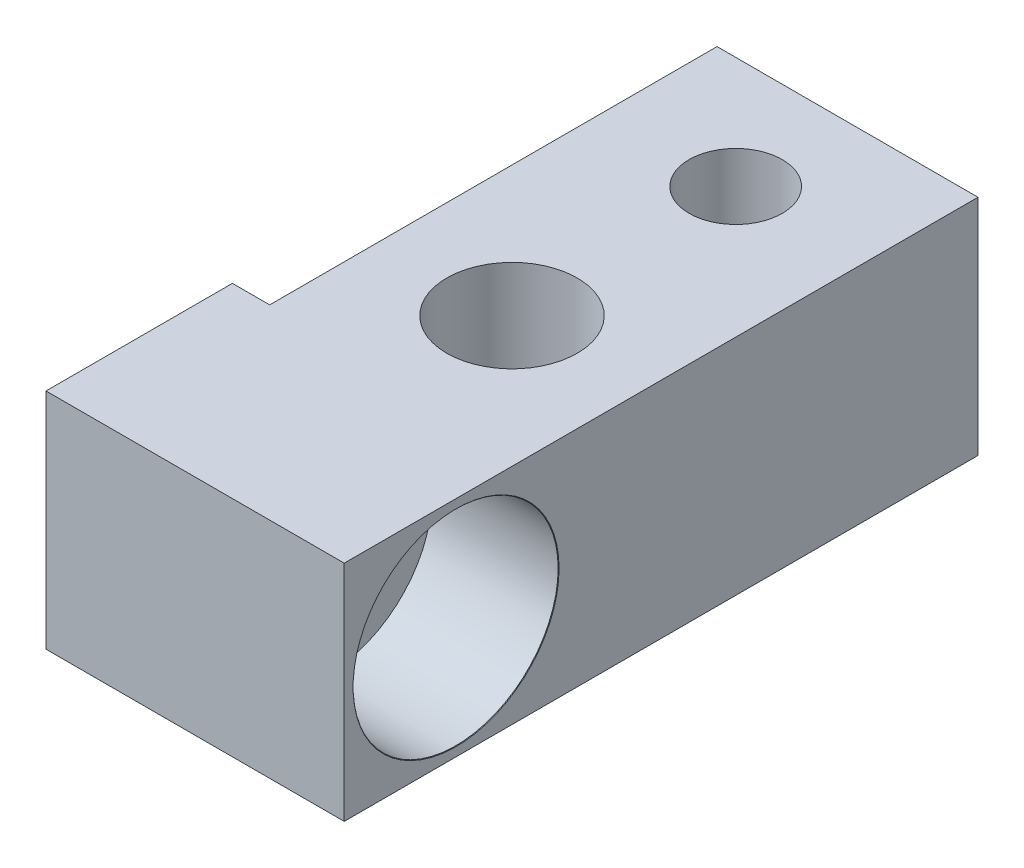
ISO-10303-21;
HEADER;
FILE_DESCRIPTION(('STEP AP214'),'2;1');
FILE_NAME('part.step','',(''),(''),'','','');
FILE_SCHEMA(('AUTOMOTIVE_DESIGN { 1 0 10303 214 1 1 1 1 }'));
ENDSEC;
DATA;
#1=APPLICATION_CONTEXT('core data for automotive mechanical design processes');
#2=APPLICATION_PROTOCOL_DEFINITION('international standard','automotive_design',2000,#1);
#3=PRODUCT_CONTEXT('',#1,'mechanical');
#4=PRODUCT('Part','Part','',(#3));
#5=PRODUCT_RELATED_PRODUCT_CATEGORY('part','',(#4));
#6=PRODUCT_DEFINITION_FORMATION('','',#4);
#7=PRODUCT_DEFINITION_CONTEXT('part definition',#1,'design');
#8=PRODUCT_DEFINITION('design','',#6,#7);
#9=PRODUCT_DEFINITION_SHAPE('','',#8);
#10=(LENGTH_UNIT() NAMED_UNIT(*) SI_UNIT(.MILLI.,.METRE.));
#11=(NAMED_UNIT(*) PLANE_ANGLE_UNIT() SI_UNIT($,.RADIAN.));
#12=(NAMED_UNIT(*) SI_UNIT($,.STERADIAN.) SOLID_ANGLE_UNIT());
#13=UNCERTAINTY_MEASURE_WITH_UNIT(LENGTH_MEASURE(1.E-05),#10,'distance_accuracy_value','');
#14=(GEOMETRIC_REPRESENTATION_CONTEXT(3) GLOBAL_UNCERTAINTY_ASSIGNED_CONTEXT((#13)) GLOBAL_UNIT_ASSIGNED_CONTEXT((#10,
#11,#12)) REPRESENTATION_CONTEXT('',''));
#15=CARTESIAN_POINT('',(0.,0.,0.));
#16=DIRECTION('',(0.,0.,1.));
#17=DIRECTION('',(1.,0.,0.));
#18=AXIS2_PLACEMENT_3D('',#15,#16,#17);
#19=CARTESIAN_POINT('',(87.5,11.1125258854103,-34.));
#20=DIRECTION('',(-1.,0.,0.));
#21=DIRECTION('',(0.,0.,1.));
#22=AXIS2_PLACEMENT_3D('',#19,#20,#21);
#23=PLANE('',#22);
#24=CARTESIAN_POINT('',(87.5,17.1125258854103,-6.));
#25=DIRECTION('',(1.,0.,0.));
#26=DIRECTION('',(0.,0.,-1.));
#27=AXIS2_PLACEMENT_3D('',#24,#25,#26);
#28=CIRCLE('',#27,3.325);
#29=CARTESIAN_POINT('',(87.5,17.1125258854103,-9.325));
#30=VERTEX_POINT('',#29);
#31=EDGE_CURVE('E150',#30,#30,#28,.T.);
#32=ORIENTED_EDGE('',*,*,#31,.T.);
#33=EDGE_LOOP('',(#32));
#34=FACE_BOUND('',#33,.T.);
#35=DIRECTION('',(0.,1.,0.));
#36=VECTOR('',#35,1.);
#37=CARTESIAN_POINT('',(87.5,11.1125258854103,-10.));
#38=LINE('',#37,#36);
#39=CARTESIAN_POINT('',(87.5,11.1125258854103,-10.));
#40=VERTEX_POINT('',#39);
#41=CARTESIAN_POINT('',(87.5,23.1125258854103,-10.));
#42=VERTEX_POINT('',#41);
#43=EDGE_CURVE('E108',#40,#42,#38,.T.);
#44=ORIENTED_EDGE('',*,*,#43,.F.);
#45=DIRECTION('',(0.,0.,1.));
#46=VECTOR('',#45,1.);
#47=CARTESIAN_POINT('',(87.5,11.1125258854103,-34.));
#48=LINE('',#47,#46);
#49=CARTESIAN_POINT('',(87.5,11.1125258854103,0.));
#50=VERTEX_POINT('',#49);
#51=EDGE_CURVE('E19',#40,#50,#48,.T.);
#52=ORIENTED_EDGE('',*,*,#51,.T.);
#53=DIRECTION('',(0.,-1.,0.));
#54=VECTOR('',#53,1.);
#55=CARTESIAN_POINT('',(87.5,11.1125258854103,0.));
#56=LINE('',#55,#54);
#57=CARTESIAN_POINT('',(87.5,23.1125258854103,0.));
#58=VERTEX_POINT('',#57);
#59=EDGE_CURVE('E67',#58,#50,#56,.T.);
#60=ORIENTED_EDGE('',*,*,#59,.F.);
#61=DIRECTION('',(0.,0.,1.));
#62=VECTOR('',#61,1.);
#63=CARTESIAN_POINT('',(87.5,23.1125258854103,-34.));
#64=LINE('',#63,#62);
#65=EDGE_CURVE('E11',#42,#58,#64,.T.);
#66=ORIENTED_EDGE('',*,*,#65,.F.);
#67=EDGE_LOOP('',(#44,#52,#60,#66));
#68=FACE_BOUND('',#67,.T.);
#69=ADVANCED_FACE('F16',(#34,#68),#23,.T.);
#70=CARTESIAN_POINT('',(87.5,23.1125258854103,-34.));
#71=DIRECTION('',(0.,1.,0.));
#72=DIRECTION('',(0.,0.,1.));
#73=AXIS2_PLACEMENT_3D('',#70,#71,#72);
#74=PLANE('',#73);
#75=CARTESIAN_POINT('',(96.5,23.1125258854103,-16.));
#76=DIRECTION('',(0.,1.,0.));
#77=DIRECTION('',(0.,0.,1.));
#78=AXIS2_PLACEMENT_3D('',#75,#76,#77);
#79=CIRCLE('',#78,3.5);
#80=CARTESIAN_POINT('',(96.5,23.1125258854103,-12.5));
#81=VERTEX_POINT('',#80);
#82=EDGE_CURVE('E129',#81,#81,#79,.T.);
#83=ORIENTED_EDGE('',*,*,#82,.F.);
#84=EDGE_LOOP('',(#83));
#85=FACE_BOUND('',#84,.T.);
#86=CARTESIAN_POINT('',(96.5,23.1125258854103,-28.));
#87=DIRECTION('',(0.,1.,0.));
#88=DIRECTION('',(0.,0.,1.));
#89=AXIS2_PLACEMENT_3D('',#86,#87,#88);
#90=CIRCLE('',#89,2.5);
#91=CARTESIAN_POINT('',(96.5,23.1125258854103,-25.5));
#92=VERTEX_POINT('',#91);
#93=EDGE_CURVE('E123',#92,#92,#90,.T.);
#94=ORIENTED_EDGE('',*,*,#93,.F.);
#95=EDGE_LOOP('',(#94));
#96=FACE_BOUND('',#95,.T.);
#97=DIRECTION('',(0.,0.,-1.));
#98=VECTOR('',#97,1.);
#99=CARTESIAN_POINT('',(89.5,23.1125258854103,-34.));
#100=LINE('',#99,#98);
#101=CARTESIAN_POINT('',(89.5,23.1125258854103,-10.));
#102=VERTEX_POINT('',#101);
#103=CARTESIAN_POINT('',(89.5,23.1125258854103,-34.));
#104=VERTEX_POINT('',#103);
#105=EDGE_CURVE('E32',#102,#104,#100,.T.);
#106=ORIENTED_EDGE('',*,*,#105,.F.);
#107=DIRECTION('',(1.,0.,0.));
#108=VECTOR('',#107,1.);
#109=CARTESIAN_POINT('',(87.5,23.1125258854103,-10.));
#110=LINE('',#109,#108);
#111=EDGE_CURVE('E63',#42,#102,#110,.T.);
#112=ORIENTED_EDGE('',*,*,#111,.F.);
#113=ORIENTED_EDGE('',*,*,#65,.T.);
#114=DIRECTION('',(-1.,0.,0.));
#115=VECTOR('',#114,1.);
#116=CARTESIAN_POINT('',(87.5,23.1125258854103,0.));
#117=LINE('',#116,#115);
#118=CARTESIAN_POINT('',(103.5,23.1125258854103,0.));
#119=VERTEX_POINT('',#118);
#120=EDGE_CURVE('E60',#119,#58,#117,.T.);
#121=ORIENTED_EDGE('',*,*,#120,.F.);
#122=DIRECTION('',(0.,0.,1.));
#123=VECTOR('',#122,1.);
#124=CARTESIAN_POINT('',(103.5,23.1125258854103,-34.));
#125=LINE('',#124,#123);
#126=CARTESIAN_POINT('',(103.5,23.1125258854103,-34.));
#127=VERTEX_POINT('',#126);
#128=EDGE_CURVE('E24',#127,#119,#125,.T.);
#129=ORIENTED_EDGE('',*,*,#128,.F.);
#130=DIRECTION('',(-1.,0.,0.));
#131=VECTOR('',#130,1.);
#132=CARTESIAN_POINT('',(87.5,23.1125258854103,-34.));
#133=LINE('',#132,#131);
#134=EDGE_CURVE('E89',#127,#104,#133,.T.);
#135=ORIENTED_EDGE('',*,*,#134,.T.);
#136=EDGE_LOOP('',(#106,#112,#113,#121,#129,#135));
#137=FACE_BOUND('',#136,.T.);
#138=ADVANCED_FACE('F58',(#85,#96,#137),#74,.T.);
#139=CARTESIAN_POINT('',(103.5,11.1125258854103,-34.));
#140=DIRECTION('',(1.,0.,0.));
#141=DIRECTION('',(0.,0.,-1.));
#142=AXIS2_PLACEMENT_3D('',#139,#140,#141);
#143=PLANE('',#142);
#144=CARTESIAN_POINT('',(103.5,17.1125258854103,-6.));
#145=DIRECTION('',(1.,0.,0.));
#146=DIRECTION('',(0.,0.,-1.));
#147=AXIS2_PLACEMENT_3D('',#144,#145,#146);
#148=CIRCLE('',#147,5.525);
#149=CARTESIAN_POINT('',(103.5,17.1125258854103,-11.525));
#150=VERTEX_POINT('',#149);
#151=EDGE_CURVE('E147',#150,#150,#148,.T.);
#152=ORIENTED_EDGE('',*,*,#151,.F.);
#153=EDGE_LOOP('',(#152));
#154=FACE_BOUND('',#153,.T.);
#155=DIRECTION('',(0.,1.,0.));
#156=VECTOR('',#155,1.);
#157=CARTESIAN_POINT('',(103.5,11.1125258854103,0.));
#158=LINE('',#157,#156);
#159=CARTESIAN_POINT('',(103.5,11.1125258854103,0.));
#160=VERTEX_POINT('',#159);
#161=EDGE_CURVE('E78',#160,#119,#158,.T.);
#162=ORIENTED_EDGE('',*,*,#161,.F.);
#163=DIRECTION('',(0.,0.,1.));
#164=VECTOR('',#163,1.);
#165=CARTESIAN_POINT('',(103.5,11.1125258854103,-34.));
#166=LINE('',#165,#164);
#167=CARTESIAN_POINT('',(103.5,11.1125258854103,-34.));
#168=VERTEX_POINT('',#167);
#169=EDGE_CURVE('E86',#168,#160,#166,.T.);
#170=ORIENTED_EDGE('',*,*,#169,.F.);
#171=DIRECTION('',(0.,1.,0.));
#172=VECTOR('',#171,1.);
#173=CARTESIAN_POINT('',(103.5,11.1125258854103,-34.));
#174=LINE('',#173,#172);
#175=EDGE_CURVE('E81',#168,#127,#174,.T.);
#176=ORIENTED_EDGE('',*,*,#175,.T.);
#177=ORIENTED_EDGE('',*,*,#128,.T.);
#178=EDGE_LOOP('',(#162,#170,#176,#177));
#179=FACE_BOUND('',#178,.T.);
#180=ADVANCED_FACE('F192',(#154,#179),#143,.T.);
#181=CARTESIAN_POINT('',(87.5,11.1125258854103,-34.));
#182=DIRECTION('',(0.,-1.,0.));
#183=DIRECTION('',(0.,0.,-1.));
#184=AXIS2_PLACEMENT_3D('',#181,#182,#183);
#185=PLANE('',#184);
#186=CARTESIAN_POINT('',(96.5,11.1125258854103,-16.));
#187=DIRECTION('',(0.,1.,0.));
#188=DIRECTION('',(0.,0.,1.));
#189=AXIS2_PLACEMENT_3D('',#186,#187,#188);
#190=CIRCLE('',#189,3.5);
#191=CARTESIAN_POINT('',(96.5,11.1125258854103,-12.5));
#192=VERTEX_POINT('',#191);
#193=EDGE_CURVE('E126',#192,#192,#190,.T.);
#194=ORIENTED_EDGE('',*,*,#193,.T.);
#195=EDGE_LOOP('',(#194));
#196=FACE_BOUND('',#195,.T.);
#197=CARTESIAN_POINT('',(96.5,11.1125258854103,-28.));
#198=DIRECTION('',(0.,1.,0.));
#199=DIRECTION('',(0.,0.,1.));
#200=AXIS2_PLACEMENT_3D('',#197,#198,#199);
#201=CIRCLE('',#200,2.5);
#202=CARTESIAN_POINT('',(96.5,11.1125258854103,-25.5));
#203=VERTEX_POINT('',#202);
#204=EDGE_CURVE('E118',#203,#203,#201,.T.);
#205=ORIENTED_EDGE('',*,*,#204,.T.);
#206=EDGE_LOOP('',(#205));
#207=FACE_BOUND('',#206,.T.);
#208=DIRECTION('',(0.,0.,-1.));
#209=VECTOR('',#208,1.);
#210=CARTESIAN_POINT('',(89.5,11.1125258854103,-34.));
#211=LINE('',#210,#209);
#212=CARTESIAN_POINT('',(89.5,11.1125258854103,-10.));
#213=VERTEX_POINT('',#212);
#214=CARTESIAN_POINT('',(89.5,11.1125258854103,-34.));
#215=VERTEX_POINT('',#214);
#216=EDGE_CURVE('E111',#213,#215,#211,.T.);
#217=ORIENTED_EDGE('',*,*,#216,.T.);
#218=DIRECTION('',(1.,0.,0.));
#219=VECTOR('',#218,1.);
#220=CARTESIAN_POINT('',(87.5,11.1125258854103,-34.));
#221=LINE('',#220,#219);
#222=EDGE_CURVE('E79',#215,#168,#221,.T.);
#223=ORIENTED_EDGE('',*,*,#222,.T.);
#224=ORIENTED_EDGE('',*,*,#169,.T.);
#225=DIRECTION('',(1.,0.,0.));
#226=VECTOR('',#225,1.);
#227=CARTESIAN_POINT('',(87.5,11.1125258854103,0.));
#228=LINE('',#227,#226);
#229=EDGE_CURVE('E72',#50,#160,#228,.T.);
#230=ORIENTED_EDGE('',*,*,#229,.F.);
#231=ORIENTED_EDGE('',*,*,#51,.F.);
#232=DIRECTION('',(1.,0.,0.));
#233=VECTOR('',#232,1.);
#234=CARTESIAN_POINT('',(87.5,11.1125258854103,-10.));
#235=LINE('',#234,#233);
#236=EDGE_CURVE('E99',#40,#213,#235,.T.);
#237=ORIENTED_EDGE('',*,*,#236,.T.);
#238=EDGE_LOOP('',(#217,#223,#224,#230,#231,#237));
#239=FACE_BOUND('',#238,.T.);
#240=ADVANCED_FACE('F94',(#196,#207,#239),#185,.T.);
#241=CARTESIAN_POINT('',(0.,0.,-34.));
#242=DIRECTION('',(0.,0.,-1.));
#243=DIRECTION('',(-1.,0.,0.));
#244=AXIS2_PLACEMENT_3D('',#241,#242,#243);
#245=PLANE('',#244);
#246=DIRECTION('',(0.,1.,0.));
#247=VECTOR('',#246,1.);
#248=CARTESIAN_POINT('',(89.5,11.1125258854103,-34.));
#249=LINE('',#248,#247);
#250=EDGE_CURVE('E73',#215,#104,#249,.T.);
#251=ORIENTED_EDGE('',*,*,#250,.T.);
#252=ORIENTED_EDGE('',*,*,#134,.F.);
#253=ORIENTED_EDGE('',*,*,#175,.F.);
#254=ORIENTED_EDGE('',*,*,#222,.F.);
#255=EDGE_LOOP('',(#251,#252,#253,#254));
#256=FACE_BOUND('',#255,.T.);
#257=ADVANCED_FACE('F199',(#256),#245,.T.);
#258=CARTESIAN_POINT('',(0.,0.,0.));
#259=DIRECTION('',(0.,0.,-1.));
#260=DIRECTION('',(-1.,0.,0.));
#261=AXIS2_PLACEMENT_3D('',#258,#259,#260);
#262=PLANE('',#261);
#263=ORIENTED_EDGE('',*,*,#59,.T.);
#264=ORIENTED_EDGE('',*,*,#229,.T.);
#265=ORIENTED_EDGE('',*,*,#161,.T.);
#266=ORIENTED_EDGE('',*,*,#120,.T.);
#267=EDGE_LOOP('',(#263,#264,#265,#266));
#268=FACE_BOUND('',#267,.T.);
#269=ADVANCED_FACE('F76',(#268),#262,.F.);
#270=CARTESIAN_POINT('',(89.5,11.1125258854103,-34.));
#271=DIRECTION('',(1.,0.,0.));
#272=DIRECTION('',(0.,0.,-1.));
#273=AXIS2_PLACEMENT_3D('',#270,#271,#272);
#274=PLANE('',#273);
#275=ORIENTED_EDGE('',*,*,#105,.T.);
#276=ORIENTED_EDGE('',*,*,#250,.F.);
#277=ORIENTED_EDGE('',*,*,#216,.F.);
#278=DIRECTION('',(0.,1.,0.));
#279=VECTOR('',#278,1.);
#280=CARTESIAN_POINT('',(89.5,11.1125258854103,-10.));
#281=LINE('',#280,#279);
#282=EDGE_CURVE('E110',#213,#102,#281,.T.);
#283=ORIENTED_EDGE('',*,*,#282,.T.);
#284=EDGE_LOOP('',(#275,#276,#277,#283));
#285=FACE_BOUND('',#284,.T.);
#286=ADVANCED_FACE('F201',(#285),#274,.F.);
#287=CARTESIAN_POINT('',(87.5,11.1125258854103,-10.));
#288=DIRECTION('',(0.,0.,1.));
#289=DIRECTION('',(1.,0.,0.));
#290=AXIS2_PLACEMENT_3D('',#287,#288,#289);
#291=PLANE('',#290);
#292=ORIENTED_EDGE('',*,*,#111,.T.);
#293=ORIENTED_EDGE('',*,*,#282,.F.);
#294=ORIENTED_EDGE('',*,*,#236,.F.);
#295=ORIENTED_EDGE('',*,*,#43,.T.);
#296=EDGE_LOOP('',(#292,#293,#294,#295));
#297=FACE_BOUND('',#296,.T.);
#298=ADVANCED_FACE('F109',(#297),#291,.F.);
#299=CARTESIAN_POINT('',(96.5,23.1125258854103,-28.));
#300=DIRECTION('',(0.,1.,0.));
#301=DIRECTION('',(0.,0.,1.));
#302=AXIS2_PLACEMENT_3D('',#299,#300,#301);
#303=CYLINDRICAL_SURFACE('',#302,2.5);
#304=ORIENTED_EDGE('',*,*,#204,.F.);
#305=EDGE_LOOP('',(#304));
#306=FACE_BOUND('',#305,.T.);
#307=ORIENTED_EDGE('',*,*,#93,.T.);
#308=EDGE_LOOP('',(#307));
#309=FACE_BOUND('',#308,.T.);
#310=ADVANCED_FACE('F210',(#306,#309),#303,.F.);
#311=CARTESIAN_POINT('',(96.5,23.1125258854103,-16.));
#312=DIRECTION('',(0.,1.,0.));
#313=DIRECTION('',(0.,0.,1.));
#314=AXIS2_PLACEMENT_3D('',#311,#312,#313);
#315=CYLINDRICAL_SURFACE('',#314,3.5);
#316=ORIENTED_EDGE('',*,*,#193,.F.);
#317=EDGE_LOOP('',(#316));
#318=FACE_BOUND('',#317,.T.);
#319=ORIENTED_EDGE('',*,*,#82,.T.);
#320=EDGE_LOOP('',(#319));
#321=FACE_BOUND('',#320,.T.);
#322=ADVANCED_FACE('F159',(#318,#321),#315,.F.);
#323=CARTESIAN_POINT('',(87.525,17.1125258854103,-6.));
#324=DIRECTION('',(-1.,0.,0.));
#325=DIRECTION('',(0.,0.,1.));
#326=AXIS2_PLACEMENT_3D('',#323,#324,#325);
#327=CONICAL_SURFACE('',#326,3.3,0.785398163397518);
#328=ORIENTED_EDGE('',*,*,#31,.F.);
#329=EDGE_LOOP('',(#328));
#330=FACE_BOUND('',#329,.T.);
#331=CARTESIAN_POINT('',(87.525,17.1125258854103,-6.));
#332=DIRECTION('',(1.,0.,0.));
#333=DIRECTION('',(0.,0.,-1.));
#334=AXIS2_PLACEMENT_3D('',#331,#332,#333);
#335=CIRCLE('',#334,3.3);
#336=CARTESIAN_POINT('',(87.525,17.1125258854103,-9.3));
#337=VERTEX_POINT('',#336);
#338=EDGE_CURVE('E132',#337,#337,#335,.T.);
#339=ORIENTED_EDGE('',*,*,#338,.T.);
#340=EDGE_LOOP('',(#339));
#341=FACE_BOUND('',#340,.T.);
#342=ADVANCED_FACE('F155',(#330,#341),#327,.F.);
#343=CARTESIAN_POINT('',(103.5,17.1125258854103,-6.));
#344=DIRECTION('',(1.,0.,0.));
#345=DIRECTION('',(0.,0.,-1.));
#346=AXIS2_PLACEMENT_3D('',#343,#344,#345);
#347=CYLINDRICAL_SURFACE('',#346,3.3);
#348=ORIENTED_EDGE('',*,*,#338,.F.);
#349=EDGE_LOOP('',(#348));
#350=FACE_BOUND('',#349,.T.);
#351=CARTESIAN_POINT('',(96.675,17.1125258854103,-6.));
#352=DIRECTION('',(1.,0.,0.));
#353=DIRECTION('',(0.,0.,-1.));
#354=AXIS2_PLACEMENT_3D('',#351,#352,#353);
#355=CIRCLE('',#354,3.3);
#356=CARTESIAN_POINT('',(96.675,17.1125258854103,-9.3));
#357=VERTEX_POINT('',#356);
#358=EDGE_CURVE('E135',#357,#357,#355,.T.);
#359=ORIENTED_EDGE('',*,*,#358,.T.);
#360=EDGE_LOOP('',(#359));
#361=FACE_BOUND('',#360,.T.);
#362=ADVANCED_FACE('F158',(#350,#361),#347,.F.);
#363=CARTESIAN_POINT('',(96.7,17.1125258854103,-6.));
#364=DIRECTION('',(1.,0.,0.));
#365=DIRECTION('',(0.,0.,-1.));
#366=AXIS2_PLACEMENT_3D('',#363,#364,#365);
#367=CONICAL_SURFACE('',#366,3.325,0.785398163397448);
#368=ORIENTED_EDGE('',*,*,#358,.F.);
#369=EDGE_LOOP('',(#368));
#370=FACE_BOUND('',#369,.T.);
#371=CARTESIAN_POINT('',(96.7,17.1125258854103,-6.));
#372=DIRECTION('',(1.,0.,0.));
#373=DIRECTION('',(0.,0.,-1.));
#374=AXIS2_PLACEMENT_3D('',#371,#372,#373);
#375=CIRCLE('',#374,3.325);
#376=CARTESIAN_POINT('',(96.7,17.1125258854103,-9.325));
#377=VERTEX_POINT('',#376);
#378=EDGE_CURVE('E138',#377,#377,#375,.T.);
#379=ORIENTED_EDGE('',*,*,#378,.T.);
#380=EDGE_LOOP('',(#379));
#381=FACE_BOUND('',#380,.T.);
#382=ADVANCED_FACE('F165',(#370,#381),#367,.F.);
#383=CARTESIAN_POINT('',(96.7,20.4375258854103,-6.));
#384=DIRECTION('',(-1.,0.,0.));
#385=DIRECTION('',(0.,0.,1.));
#386=AXIS2_PLACEMENT_3D('',#383,#384,#385);
#387=PLANE('',#386);
#388=ORIENTED_EDGE('',*,*,#378,.F.);
#389=EDGE_LOOP('',(#388));
#390=FACE_BOUND('',#389,.T.);
#391=CARTESIAN_POINT('',(96.7,17.1125258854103,-6.));
#392=DIRECTION('',(1.,0.,0.));
#393=DIRECTION('',(0.,0.,-1.));
#394=AXIS2_PLACEMENT_3D('',#391,#392,#393);
#395=CIRCLE('',#394,5.5);
#396=CARTESIAN_POINT('',(96.7,17.1125258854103,-11.5));
#397=VERTEX_POINT('',#396);
#398=EDGE_CURVE('E141',#397,#397,#395,.T.);
#399=ORIENTED_EDGE('',*,*,#398,.T.);
#400=EDGE_LOOP('',(#399));
#401=FACE_BOUND('',#400,.T.);
#402=ADVANCED_FACE('F171',(#390,#401),#387,.F.);
#403=CARTESIAN_POINT('',(103.5,17.1125258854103,-6.));
#404=DIRECTION('',(1.,0.,0.));
#405=DIRECTION('',(0.,0.,-1.));
#406=AXIS2_PLACEMENT_3D('',#403,#404,#405);
#407=CYLINDRICAL_SURFACE('',#406,5.5);
#408=ORIENTED_EDGE('',*,*,#398,.F.);
#409=EDGE_LOOP('',(#408));
#410=FACE_BOUND('',#409,.T.);
#411=CARTESIAN_POINT('',(103.475,17.1125258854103,-6.));
#412=DIRECTION('',(1.,0.,0.));
#413=DIRECTION('',(0.,0.,-1.));
#414=AXIS2_PLACEMENT_3D('',#411,#412,#413);
#415=CIRCLE('',#414,5.5);
#416=CARTESIAN_POINT('',(103.475,17.1125258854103,-11.5));
#417=VERTEX_POINT('',#416);
#418=EDGE_CURVE('E144',#417,#417,#415,.T.);
#419=ORIENTED_EDGE('',*,*,#418,.T.);
#420=EDGE_LOOP('',(#419));
#421=FACE_BOUND('',#420,.T.);
#422=ADVANCED_FACE('F177',(#410,#421),#407,.F.);
#423=CARTESIAN_POINT('',(103.5,17.1125258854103,-6.));
#424=DIRECTION('',(1.,0.,0.));
#425=DIRECTION('',(0.,0.,-1.));
#426=AXIS2_PLACEMENT_3D('',#423,#424,#425);
#427=CONICAL_SURFACE('',#426,5.525,0.785398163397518);
#428=ORIENTED_EDGE('',*,*,#418,.F.);
#429=EDGE_LOOP('',(#428));
#430=FACE_BOUND('',#429,.T.);
#431=ORIENTED_EDGE('',*,*,#151,.T.);
#432=EDGE_LOOP('',(#431));
#433=FACE_BOUND('',#432,.T.);
#434=ADVANCED_FACE('F183',(#430,#433),#427,.F.);
#435=CLOSED_SHELL('',(#69,#138,#180,#240,#257,#269,#286,#298,#310,#322,#342,#362,#382,#402,#422,#434));
#436=MANIFOLD_SOLID_BREP('B1',#435);
#437=ADVANCED_BREP_SHAPE_REPRESENTATION('',(#18,#436),#14);
#438=SHAPE_DEFINITION_REPRESENTATION(#9,#437);
ENDSEC;
END-ISO-10303-21;
